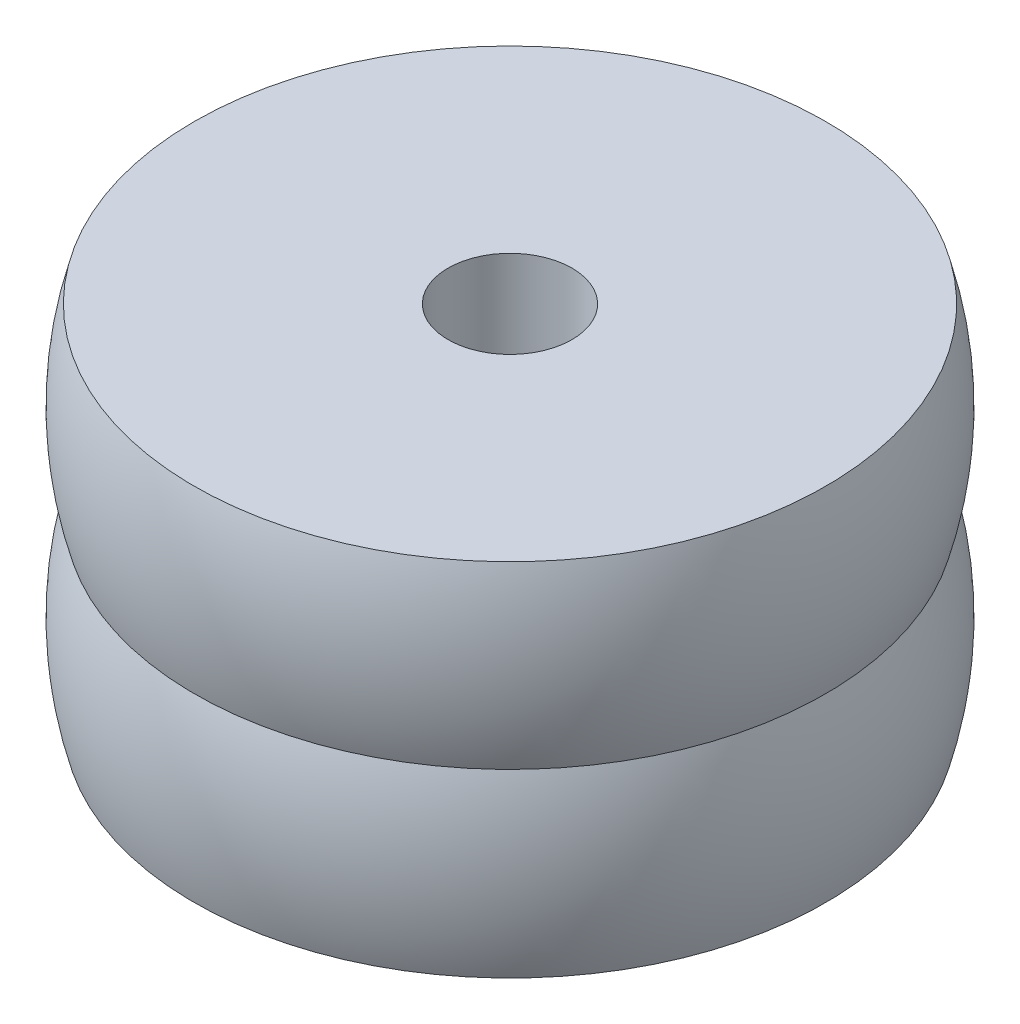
from build123d import *


with BuildPart() as part:
    # Esquisse1 → Base-R_volution (revolve)
    with BuildSketch(Plane.XY):
        with BuildLine():
            Line((-43.308397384, 49.442222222), (-8.5, 49.442222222))
            Line((-8.5, 49.442222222), (-8.5, 0))
            Line((-8.5, 0), (-43.309024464, 0))
            ThreePointArc((-43.309024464, 0), (-44.999764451, 12.365599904), (-43.229041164, 24.72))
            ThreePointArc((-43.229041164, 24.72), (-44.999768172, 37.075554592), (-43.308397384, 49.442222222))
        make_face()
    revolve(axis=Axis((0, -3.077632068, 0), (0, 1, 0)))


solid = part.part
